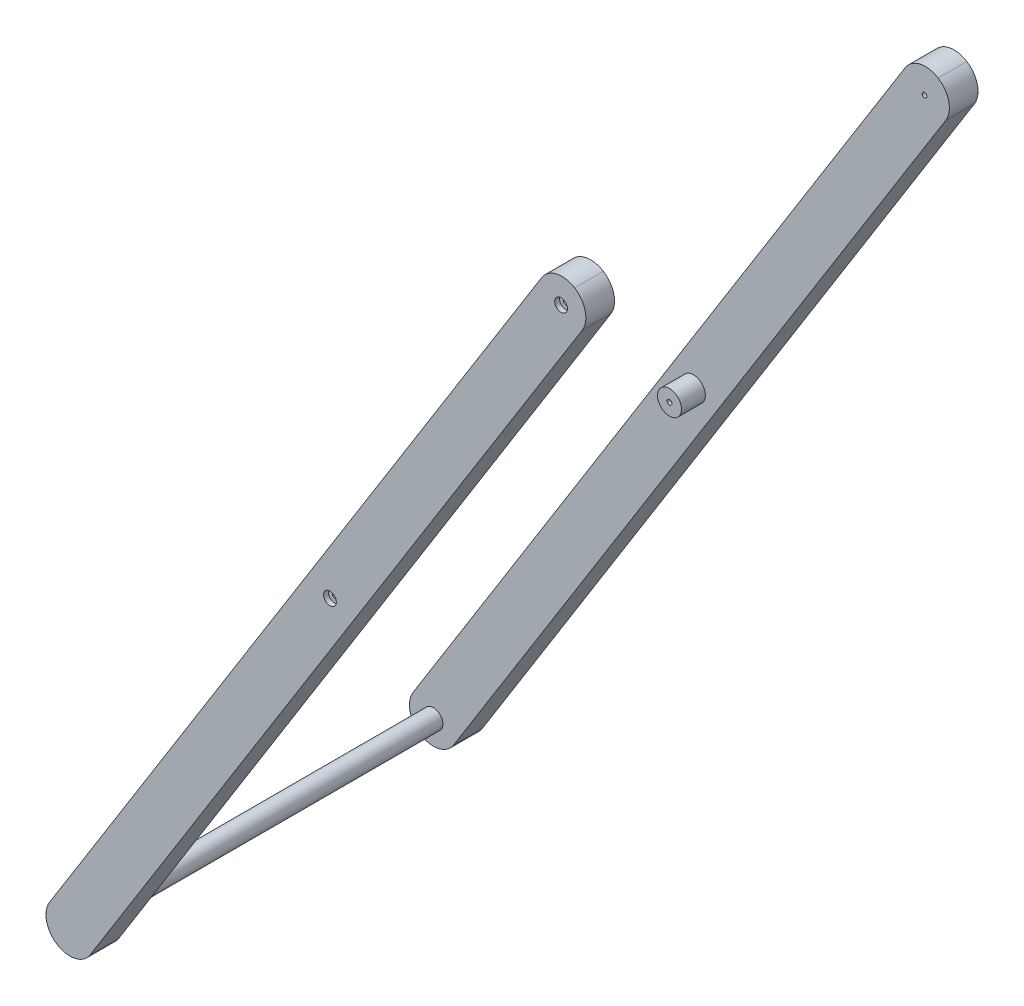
ISO-10303-21;
HEADER;
FILE_DESCRIPTION(('STEP AP214'),'2;1');
FILE_NAME('part.step','',(''),(''),'','','');
FILE_SCHEMA(('AUTOMOTIVE_DESIGN { 1 0 10303 214 1 1 1 1 }'));
ENDSEC;
DATA;
#1=APPLICATION_CONTEXT('core data for automotive mechanical design processes');
#2=APPLICATION_PROTOCOL_DEFINITION('international standard','automotive_design',2000,#1);
#3=PRODUCT_CONTEXT('',#1,'mechanical');
#4=PRODUCT('Part','Part','',(#3));
#5=PRODUCT_RELATED_PRODUCT_CATEGORY('part','',(#4));
#6=PRODUCT_DEFINITION_FORMATION('','',#4);
#7=PRODUCT_DEFINITION_CONTEXT('part definition',#1,'design');
#8=PRODUCT_DEFINITION('design','',#6,#7);
#9=PRODUCT_DEFINITION_SHAPE('','',#8);
#10=(LENGTH_UNIT() NAMED_UNIT(*) SI_UNIT(.MILLI.,.METRE.));
#11=(NAMED_UNIT(*) PLANE_ANGLE_UNIT() SI_UNIT($,.RADIAN.));
#12=(NAMED_UNIT(*) SI_UNIT($,.STERADIAN.) SOLID_ANGLE_UNIT());
#13=UNCERTAINTY_MEASURE_WITH_UNIT(LENGTH_MEASURE(1.E-05),#10,'distance_accuracy_value','');
#14=(GEOMETRIC_REPRESENTATION_CONTEXT(3) GLOBAL_UNCERTAINTY_ASSIGNED_CONTEXT((#13)) GLOBAL_UNIT_ASSIGNED_CONTEXT((#10,
#11,#12)) REPRESENTATION_CONTEXT('',''));
#15=CARTESIAN_POINT('',(0.,0.,0.));
#16=DIRECTION('',(0.,0.,1.));
#17=DIRECTION('',(1.,0.,0.));
#18=AXIS2_PLACEMENT_3D('',#15,#16,#17);
#19=CARTESIAN_POINT('',(0.,0.,105.));
#20=DIRECTION('',(0.,0.,-1.));
#21=DIRECTION('',(-1.,0.,0.));
#22=AXIS2_PLACEMENT_3D('',#19,#20,#21);
#23=PLANE('',#22);
#24=DIRECTION('',(-0.530185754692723,-0.847881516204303,0.));
#25=VECTOR('',#24,1.);
#26=CARTESIAN_POINT('',(140.764749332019,2.95278632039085,105.));
#27=LINE('',#26,#25);
#28=CARTESIAN_POINT('',(132.811963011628,-9.7654364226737,105.));
#29=VERTEX_POINT('',#28);
#30=CARTESIAN_POINT('',(-175.846018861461,-503.376204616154,105.));
#31=VERTEX_POINT('',#30);
#32=EDGE_CURVE('E225',#29,#31,#27,.T.);
#33=ORIENTED_EDGE('',*,*,#32,.F.);
#34=CARTESIAN_POINT('',(145.530185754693,-17.7182227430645,105.));
#35=DIRECTION('',(0.,0.,-1.));
#36=DIRECTION('',(-1.,0.,0.));
#37=AXIS2_PLACEMENT_3D('',#34,#35,#36);
#38=CIRCLE('',#37,15.);
#39=CARTESIAN_POINT('',(153.482972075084,-5.,105.));
#40=VERTEX_POINT('',#39);
#41=EDGE_CURVE('E250',#29,#40,#38,.T.);
#42=ORIENTED_EDGE('',*,*,#41,.T.);
#43=CARTESIAN_POINT('',(145.530185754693,-17.7182227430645,105.));
#44=DIRECTION('',(0.,0.,-1.));
#45=DIRECTION('',(-1.,0.,0.));
#46=AXIS2_PLACEMENT_3D('',#43,#44,#45);
#47=CIRCLE('',#46,15.);
#48=CARTESIAN_POINT('',(158.248408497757,-25.6710090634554,105.));
#49=VERTEX_POINT('',#48);
#50=EDGE_CURVE('E248',#40,#49,#47,.T.);
#51=ORIENTED_EDGE('',*,*,#50,.T.);
#52=DIRECTION('',(0.530185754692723,0.847881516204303,0.));
#53=VECTOR('',#52,1.);
#54=CARTESIAN_POINT('',(166.201194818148,-12.9527863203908,105.));
#55=LINE('',#54,#53);
#56=CARTESIAN_POINT('',(-150.409573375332,-519.281777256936,105.));
#57=VERTEX_POINT('',#56);
#58=EDGE_CURVE('E222',#57,#49,#55,.T.);
#59=ORIENTED_EDGE('',*,*,#58,.F.);
#60=CARTESIAN_POINT('',(-163.127796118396,-511.328990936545,105.));
#61=DIRECTION('',(0.,0.,-1.));
#62=DIRECTION('',(-1.,0.,0.));
#63=AXIS2_PLACEMENT_3D('',#60,#61,#62);
#64=CIRCLE('',#63,15.);
#65=CARTESIAN_POINT('',(-171.080582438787,-524.047213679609,105.));
#66=VERTEX_POINT('',#65);
#67=EDGE_CURVE('E234',#57,#66,#64,.T.);
#68=ORIENTED_EDGE('',*,*,#67,.T.);
#69=CARTESIAN_POINT('',(-163.127796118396,-511.328990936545,105.));
#70=DIRECTION('',(0.,0.,-1.));
#71=DIRECTION('',(-1.,0.,0.));
#72=AXIS2_PLACEMENT_3D('',#69,#70,#71);
#73=CIRCLE('',#72,15.);
#74=EDGE_CURVE('E231',#66,#31,#73,.T.);
#75=ORIENTED_EDGE('',*,*,#74,.T.);
#76=EDGE_LOOP('',(#33,#42,#51,#59,#68,#75));
#77=FACE_BOUND('',#76,.T.);
#78=CARTESIAN_POINT('',(-163.127796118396,-511.328990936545,105.));
#79=DIRECTION('',(0.,0.,-1.));
#80=DIRECTION('',(-1.,0.,0.));
#81=AXIS2_PLACEMENT_3D('',#78,#79,#80);
#82=CIRCLE('',#81,5.99999999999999);
#83=CARTESIAN_POINT('',(-169.127796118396,-511.328990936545,105.));
#84=VERTEX_POINT('',#83);
#85=EDGE_CURVE('E190',#84,#84,#82,.F.);
#86=ORIENTED_EDGE('',*,*,#85,.T.);
#87=EDGE_LOOP('',(#86));
#88=FACE_BOUND('',#87,.T.);
#89=CARTESIAN_POINT('',(145.,-18.5661042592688,105.));
#90=DIRECTION('',(0.,0.,-1.));
#91=DIRECTION('',(-1.,0.,0.));
#92=AXIS2_PLACEMENT_3D('',#89,#90,#91);
#93=CIRCLE('',#92,1.5);
#94=CARTESIAN_POINT('',(143.5,-18.5661042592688,105.));
#95=VERTEX_POINT('',#94);
#96=EDGE_CURVE('E201',#95,#95,#93,.T.);
#97=ORIENTED_EDGE('',*,*,#96,.F.);
#98=EDGE_LOOP('',(#97));
#99=FACE_BOUND('',#98,.T.);
#100=CARTESIAN_POINT('',(0.,-250.452417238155,105.));
#101=DIRECTION('',(0.,0.,-1.));
#102=DIRECTION('',(-1.,0.,0.));
#103=AXIS2_PLACEMENT_3D('',#100,#101,#102);
#104=CIRCLE('',#103,7.5);
#105=CARTESIAN_POINT('',(-7.5,-250.452417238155,105.));
#106=VERTEX_POINT('',#105);
#107=EDGE_CURVE('E652',#106,#106,#104,.T.);
#108=ORIENTED_EDGE('',*,*,#107,.F.);
#109=EDGE_LOOP('',(#108));
#110=FACE_BOUND('',#109,.T.);
#111=ADVANCED_FACE('F47',(#77,#88,#99,#110),#23,.T.);
#112=CARTESIAN_POINT('',(0.,0.,123.));
#113=DIRECTION('',(0.,0.,-1.));
#114=DIRECTION('',(-1.,0.,0.));
#115=AXIS2_PLACEMENT_3D('',#112,#113,#114);
#116=PLANE('',#115);
#117=CARTESIAN_POINT('',(145.,-18.5661042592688,123.));
#118=DIRECTION('',(0.,0.,1.));
#119=DIRECTION('',(1.,0.,0.));
#120=AXIS2_PLACEMENT_3D('',#117,#118,#119);
#121=CIRCLE('',#120,3.99999999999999);
#122=CARTESIAN_POINT('',(149.,-18.5661042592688,123.));
#123=VERTEX_POINT('',#122);
#124=EDGE_CURVE('E204',#123,#123,#121,.T.);
#125=ORIENTED_EDGE('',*,*,#124,.F.);
#126=EDGE_LOOP('',(#125));
#127=FACE_BOUND('',#126,.T.);
#128=CARTESIAN_POINT('',(0.,-250.452417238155,123.));
#129=DIRECTION('',(0.,0.,1.));
#130=DIRECTION('',(1.,0.,0.));
#131=AXIS2_PLACEMENT_3D('',#128,#129,#130);
#132=CIRCLE('',#131,4.);
#133=CARTESIAN_POINT('',(4.,-250.452417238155,123.));
#134=VERTEX_POINT('',#133);
#135=EDGE_CURVE('E213',#134,#134,#132,.T.);
#136=ORIENTED_EDGE('',*,*,#135,.F.);
#137=EDGE_LOOP('',(#136));
#138=FACE_BOUND('',#137,.T.);
#139=CARTESIAN_POINT('',(145.530185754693,-17.7182227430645,123.));
#140=DIRECTION('',(0.,0.,-1.));
#141=DIRECTION('',(-1.,0.,0.));
#142=AXIS2_PLACEMENT_3D('',#139,#140,#141);
#143=CIRCLE('',#142,15.);
#144=CARTESIAN_POINT('',(158.248408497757,-25.6710090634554,123.));
#145=VERTEX_POINT('',#144);
#146=CARTESIAN_POINT('',(153.482972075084,-5.,123.));
#147=VERTEX_POINT('',#146);
#148=EDGE_CURVE('E63',#145,#147,#143,.F.);
#149=ORIENTED_EDGE('',*,*,#148,.T.);
#150=CARTESIAN_POINT('',(145.530185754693,-17.7182227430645,123.));
#151=DIRECTION('',(0.,0.,-1.));
#152=DIRECTION('',(-1.,0.,0.));
#153=AXIS2_PLACEMENT_3D('',#150,#151,#152);
#154=CIRCLE('',#153,15.);
#155=CARTESIAN_POINT('',(132.811963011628,-9.7654364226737,123.));
#156=VERTEX_POINT('',#155);
#157=EDGE_CURVE('E56',#147,#156,#154,.F.);
#158=ORIENTED_EDGE('',*,*,#157,.T.);
#159=DIRECTION('',(-0.530185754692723,-0.847881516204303,0.));
#160=VECTOR('',#159,1.);
#161=CARTESIAN_POINT('',(140.764749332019,2.95278632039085,123.));
#162=LINE('',#161,#160);
#163=CARTESIAN_POINT('',(-175.846018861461,-503.376204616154,123.));
#164=VERTEX_POINT('',#163);
#165=EDGE_CURVE('E219',#156,#164,#162,.T.);
#166=ORIENTED_EDGE('',*,*,#165,.T.);
#167=CARTESIAN_POINT('',(-163.127796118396,-511.328990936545,123.));
#168=DIRECTION('',(0.,0.,-1.));
#169=DIRECTION('',(-1.,0.,0.));
#170=AXIS2_PLACEMENT_3D('',#167,#168,#169);
#171=CIRCLE('',#170,15.);
#172=CARTESIAN_POINT('',(-171.080582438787,-524.047213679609,123.));
#173=VERTEX_POINT('',#172);
#174=EDGE_CURVE('E236',#164,#173,#171,.F.);
#175=ORIENTED_EDGE('',*,*,#174,.T.);
#176=CARTESIAN_POINT('',(-163.127796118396,-511.328990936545,123.));
#177=DIRECTION('',(0.,0.,-1.));
#178=DIRECTION('',(-1.,0.,0.));
#179=AXIS2_PLACEMENT_3D('',#176,#177,#178);
#180=CIRCLE('',#179,15.);
#181=CARTESIAN_POINT('',(-150.409573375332,-519.281777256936,123.));
#182=VERTEX_POINT('',#181);
#183=EDGE_CURVE('E238',#173,#182,#180,.F.);
#184=ORIENTED_EDGE('',*,*,#183,.T.);
#185=DIRECTION('',(0.530185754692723,0.847881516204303,0.));
#186=VECTOR('',#185,1.);
#187=CARTESIAN_POINT('',(166.201194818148,-12.9527863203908,123.));
#188=LINE('',#187,#186);
#189=EDGE_CURVE('E221',#182,#145,#188,.T.);
#190=ORIENTED_EDGE('',*,*,#189,.T.);
#191=EDGE_LOOP('',(#149,#158,#166,#175,#184,#190));
#192=FACE_BOUND('',#191,.T.);
#193=ADVANCED_FACE('F255',(#127,#138,#192),#116,.F.);
#194=CARTESIAN_POINT('',(140.764749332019,2.95278632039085,123.));
#195=DIRECTION('',(0.847881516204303,-0.530185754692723,0.));
#196=DIRECTION('',(0.530185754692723,0.847881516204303,0.));
#197=AXIS2_PLACEMENT_3D('',#194,#195,#196);
#198=PLANE('',#197);
#199=ORIENTED_EDGE('',*,*,#165,.F.);
#200=DIRECTION('',(0.,0.,-1.));
#201=VECTOR('',#200,1.);
#202=CARTESIAN_POINT('',(132.811963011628,-9.76543642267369,123.));
#203=LINE('',#202,#201);
#204=EDGE_CURVE('E243',#156,#29,#203,.T.);
#205=ORIENTED_EDGE('',*,*,#204,.T.);
#206=ORIENTED_EDGE('',*,*,#32,.T.);
#207=DIRECTION('',(0.,0.,-1.));
#208=VECTOR('',#207,1.);
#209=CARTESIAN_POINT('',(-175.846018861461,-503.376204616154,123.));
#210=LINE('',#209,#208);
#211=EDGE_CURVE('E240',#31,#164,#210,.F.);
#212=ORIENTED_EDGE('',*,*,#211,.T.);
#213=EDGE_LOOP('',(#199,#205,#206,#212));
#214=FACE_BOUND('',#213,.T.);
#215=ADVANCED_FACE('F260',(#214),#198,.F.);
#216=CARTESIAN_POINT('',(166.201194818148,-12.9527863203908,123.));
#217=DIRECTION('',(-0.847881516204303,0.530185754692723,0.));
#218=DIRECTION('',(-0.530185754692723,-0.847881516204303,0.));
#219=AXIS2_PLACEMENT_3D('',#216,#217,#218);
#220=PLANE('',#219);
#221=ORIENTED_EDGE('',*,*,#58,.T.);
#222=DIRECTION('',(0.,0.,-1.));
#223=VECTOR('',#222,1.);
#224=CARTESIAN_POINT('',(158.248408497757,-25.6710090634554,123.));
#225=LINE('',#224,#223);
#226=EDGE_CURVE('E12',#49,#145,#225,.F.);
#227=ORIENTED_EDGE('',*,*,#226,.T.);
#228=ORIENTED_EDGE('',*,*,#189,.F.);
#229=DIRECTION('',(0.,0.,-1.));
#230=VECTOR('',#229,1.);
#231=CARTESIAN_POINT('',(-150.409573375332,-519.281777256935,123.));
#232=LINE('',#231,#230);
#233=EDGE_CURVE('E224',#182,#57,#232,.T.);
#234=ORIENTED_EDGE('',*,*,#233,.T.);
#235=EDGE_LOOP('',(#221,#227,#228,#234));
#236=FACE_BOUND('',#235,.T.);
#237=ADVANCED_FACE('F289',(#236),#220,.F.);
#238=CARTESIAN_POINT('',(-163.127796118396,-511.328990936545,123.));
#239=DIRECTION('',(0.,0.,-1.));
#240=DIRECTION('',(-1.,0.,0.));
#241=AXIS2_PLACEMENT_3D('',#238,#239,#240);
#242=CYLINDRICAL_SURFACE('',#241,15.);
#243=DIRECTION('',(0.,0.,-1.));
#244=VECTOR('',#243,1.);
#245=CARTESIAN_POINT('',(-171.080582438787,-524.047213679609,123.));
#246=LINE('',#245,#244);
#247=EDGE_CURVE('E227',#173,#66,#246,.T.);
#248=ORIENTED_EDGE('',*,*,#247,.F.);
#249=ORIENTED_EDGE('',*,*,#174,.F.);
#250=ORIENTED_EDGE('',*,*,#211,.F.);
#251=ORIENTED_EDGE('',*,*,#74,.F.);
#252=EDGE_LOOP('',(#248,#249,#250,#251));
#253=FACE_BOUND('',#252,.T.);
#254=ADVANCED_FACE('F277',(#253),#242,.T.);
#255=CARTESIAN_POINT('',(-163.127796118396,-511.328990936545,123.));
#256=DIRECTION('',(0.,0.,-1.));
#257=DIRECTION('',(-1.,0.,0.));
#258=AXIS2_PLACEMENT_3D('',#255,#256,#257);
#259=CYLINDRICAL_SURFACE('',#258,15.);
#260=ORIENTED_EDGE('',*,*,#183,.F.);
#261=ORIENTED_EDGE('',*,*,#247,.T.);
#262=ORIENTED_EDGE('',*,*,#67,.F.);
#263=ORIENTED_EDGE('',*,*,#233,.F.);
#264=EDGE_LOOP('',(#260,#261,#262,#263));
#265=FACE_BOUND('',#264,.T.);
#266=ADVANCED_FACE('F271',(#265),#259,.T.);
#267=CARTESIAN_POINT('',(145.530185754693,-17.7182227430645,123.));
#268=DIRECTION('',(0.,0.,-1.));
#269=DIRECTION('',(-1.,0.,0.));
#270=AXIS2_PLACEMENT_3D('',#267,#268,#269);
#271=CYLINDRICAL_SURFACE('',#270,15.);
#272=DIRECTION('',(0.,0.,-1.));
#273=VECTOR('',#272,1.);
#274=CARTESIAN_POINT('',(153.482972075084,-5.,123.));
#275=LINE('',#274,#273);
#276=EDGE_CURVE('E51',#147,#40,#275,.T.);
#277=ORIENTED_EDGE('',*,*,#276,.F.);
#278=ORIENTED_EDGE('',*,*,#148,.F.);
#279=ORIENTED_EDGE('',*,*,#226,.F.);
#280=ORIENTED_EDGE('',*,*,#50,.F.);
#281=EDGE_LOOP('',(#277,#278,#279,#280));
#282=FACE_BOUND('',#281,.T.);
#283=ADVANCED_FACE('F49',(#282),#271,.T.);
#284=CARTESIAN_POINT('',(145.530185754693,-17.7182227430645,123.));
#285=DIRECTION('',(0.,0.,-1.));
#286=DIRECTION('',(-1.,0.,0.));
#287=AXIS2_PLACEMENT_3D('',#284,#285,#286);
#288=CYLINDRICAL_SURFACE('',#287,15.);
#289=ORIENTED_EDGE('',*,*,#157,.F.);
#290=ORIENTED_EDGE('',*,*,#276,.T.);
#291=ORIENTED_EDGE('',*,*,#41,.F.);
#292=ORIENTED_EDGE('',*,*,#204,.F.);
#293=EDGE_LOOP('',(#289,#290,#291,#292));
#294=FACE_BOUND('',#293,.T.);
#295=ADVANCED_FACE('F264',(#294),#288,.T.);
#296=CARTESIAN_POINT('',(0.,-250.452417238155,120.));
#297=DIRECTION('',(0.,0.,1.));
#298=DIRECTION('',(1.,0.,0.));
#299=AXIS2_PLACEMENT_3D('',#296,#297,#298);
#300=CYLINDRICAL_SURFACE('',#299,4.);
#301=CARTESIAN_POINT('',(0.,-250.452417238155,120.));
#302=DIRECTION('',(0.,0.,1.));
#303=DIRECTION('',(1.,0.,0.));
#304=AXIS2_PLACEMENT_3D('',#301,#302,#303);
#305=CIRCLE('',#304,4.);
#306=CARTESIAN_POINT('',(4.,-250.452417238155,120.));
#307=VERTEX_POINT('',#306);
#308=EDGE_CURVE('E214',#307,#307,#305,.T.);
#309=ORIENTED_EDGE('',*,*,#308,.F.);
#310=EDGE_LOOP('',(#309));
#311=FACE_BOUND('',#310,.T.);
#312=ORIENTED_EDGE('',*,*,#135,.T.);
#313=EDGE_LOOP('',(#312));
#314=FACE_BOUND('',#313,.T.);
#315=ADVANCED_FACE('F276',(#311,#314),#300,.F.);
#316=CARTESIAN_POINT('',(0.,-250.452417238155,120.));
#317=DIRECTION('',(0.,0.,1.));
#318=DIRECTION('',(1.,0.,0.));
#319=AXIS2_PLACEMENT_3D('',#316,#317,#318);
#320=PLANE('',#319);
#321=CARTESIAN_POINT('',(0.,-250.452417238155,120.));
#322=DIRECTION('',(0.,0.,1.));
#323=DIRECTION('',(1.,0.,0.));
#324=AXIS2_PLACEMENT_3D('',#321,#322,#323);
#325=CIRCLE('',#324,1.5);
#326=CARTESIAN_POINT('',(1.5,-250.452417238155,120.));
#327=VERTEX_POINT('',#326);
#328=EDGE_CURVE('E208',#327,#327,#325,.T.);
#329=ORIENTED_EDGE('',*,*,#328,.F.);
#330=EDGE_LOOP('',(#329));
#331=FACE_BOUND('',#330,.T.);
#332=ORIENTED_EDGE('',*,*,#308,.T.);
#333=EDGE_LOOP('',(#332));
#334=FACE_BOUND('',#333,.T.);
#335=ADVANCED_FACE('F330',(#331,#334),#320,.T.);
#336=CARTESIAN_POINT('',(0.,-250.452417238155,67.7573593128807));
#337=DIRECTION('',(0.,0.,1.));
#338=DIRECTION('',(1.,0.,0.));
#339=AXIS2_PLACEMENT_3D('',#336,#337,#338);
#340=CYLINDRICAL_SURFACE('',#339,1.5);
#341=ORIENTED_EDGE('',*,*,#328,.T.);
#342=EDGE_LOOP('',(#341));
#343=FACE_BOUND('',#342,.T.);
#344=CARTESIAN_POINT('',(0.,-250.452417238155,90.));
#345=DIRECTION('',(0.,0.,-1.));
#346=DIRECTION('',(-1.,0.,0.));
#347=AXIS2_PLACEMENT_3D('',#344,#345,#346);
#348=CIRCLE('',#347,1.5);
#349=CARTESIAN_POINT('',(-1.5,-250.452417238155,90.));
#350=VERTEX_POINT('',#349);
#351=EDGE_CURVE('E658',#350,#350,#348,.F.);
#352=ORIENTED_EDGE('',*,*,#351,.F.);
#353=EDGE_LOOP('',(#352));
#354=FACE_BOUND('',#353,.T.);
#355=ADVANCED_FACE('F339',(#343,#354),#340,.F.);
#356=CARTESIAN_POINT('',(145.,-18.5661042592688,120.));
#357=DIRECTION('',(0.,0.,1.));
#358=DIRECTION('',(1.,0.,0.));
#359=AXIS2_PLACEMENT_3D('',#356,#357,#358);
#360=CYLINDRICAL_SURFACE('',#359,3.99999999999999);
#361=CARTESIAN_POINT('',(145.,-18.5661042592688,120.));
#362=DIRECTION('',(0.,0.,1.));
#363=DIRECTION('',(1.,0.,0.));
#364=AXIS2_PLACEMENT_3D('',#361,#362,#363);
#365=CIRCLE('',#364,3.99999999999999);
#366=CARTESIAN_POINT('',(149.,-18.5661042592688,120.));
#367=VERTEX_POINT('',#366);
#368=EDGE_CURVE('E205',#367,#367,#365,.T.);
#369=ORIENTED_EDGE('',*,*,#368,.F.);
#370=EDGE_LOOP('',(#369));
#371=FACE_BOUND('',#370,.T.);
#372=ORIENTED_EDGE('',*,*,#124,.T.);
#373=EDGE_LOOP('',(#372));
#374=FACE_BOUND('',#373,.T.);
#375=ADVANCED_FACE('F349',(#371,#374),#360,.F.);
#376=CARTESIAN_POINT('',(145.,-18.5661042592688,120.));
#377=DIRECTION('',(0.,0.,1.));
#378=DIRECTION('',(1.,0.,0.));
#379=AXIS2_PLACEMENT_3D('',#376,#377,#378);
#380=PLANE('',#379);
#381=CARTESIAN_POINT('',(145.,-18.5661042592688,120.));
#382=DIRECTION('',(0.,0.,1.));
#383=DIRECTION('',(1.,0.,0.));
#384=AXIS2_PLACEMENT_3D('',#381,#382,#383);
#385=CIRCLE('',#384,1.5);
#386=CARTESIAN_POINT('',(146.5,-18.5661042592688,120.));
#387=VERTEX_POINT('',#386);
#388=EDGE_CURVE('E198',#387,#387,#385,.T.);
#389=ORIENTED_EDGE('',*,*,#388,.F.);
#390=EDGE_LOOP('',(#389));
#391=FACE_BOUND('',#390,.T.);
#392=ORIENTED_EDGE('',*,*,#368,.T.);
#393=EDGE_LOOP('',(#392));
#394=FACE_BOUND('',#393,.T.);
#395=ADVANCED_FACE('F363',(#391,#394),#380,.T.);
#396=CARTESIAN_POINT('',(145.,-18.5661042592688,85.7573593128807));
#397=DIRECTION('',(0.,0.,1.));
#398=DIRECTION('',(1.,0.,0.));
#399=AXIS2_PLACEMENT_3D('',#396,#397,#398);
#400=CYLINDRICAL_SURFACE('',#399,1.5);
#401=ORIENTED_EDGE('',*,*,#96,.T.);
#402=EDGE_LOOP('',(#401));
#403=FACE_BOUND('',#402,.T.);
#404=ORIENTED_EDGE('',*,*,#388,.T.);
#405=EDGE_LOOP('',(#404));
#406=FACE_BOUND('',#405,.T.);
#407=ADVANCED_FACE('F373',(#403,#406),#400,.F.);
#408=CARTESIAN_POINT('',(0.,0.,-123.));
#409=DIRECTION('',(0.,0.,1.));
#410=DIRECTION('',(-1.,0.,0.));
#411=AXIS2_PLACEMENT_3D('',#408,#409,#410);
#412=PLANE('',#411);
#413=CARTESIAN_POINT('',(145.,-18.5661042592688,-123.));
#414=DIRECTION('',(0.,0.,1.));
#415=DIRECTION('',(1.,0.,0.));
#416=AXIS2_PLACEMENT_3D('',#413,#414,#415);
#417=CIRCLE('',#416,3.99999999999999);
#418=CARTESIAN_POINT('',(149.,-18.5661042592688,-123.));
#419=VERTEX_POINT('',#418);
#420=EDGE_CURVE('E675',#419,#419,#417,.T.);
#421=ORIENTED_EDGE('',*,*,#420,.T.);
#422=EDGE_LOOP('',(#421));
#423=FACE_BOUND('',#422,.T.);
#424=CARTESIAN_POINT('',(0.,-250.452417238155,-123.));
#425=DIRECTION('',(0.,0.,1.));
#426=DIRECTION('',(1.,0.,0.));
#427=AXIS2_PLACEMENT_3D('',#424,#425,#426);
#428=CIRCLE('',#427,4.);
#429=CARTESIAN_POINT('',(4.,-250.452417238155,-123.));
#430=VERTEX_POINT('',#429);
#431=EDGE_CURVE('E684',#430,#430,#428,.T.);
#432=ORIENTED_EDGE('',*,*,#431,.T.);
#433=EDGE_LOOP('',(#432));
#434=FACE_BOUND('',#433,.T.);
#435=CARTESIAN_POINT('',(145.530185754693,-17.7182227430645,-123.));
#436=DIRECTION('',(0.,0.,-1.));
#437=DIRECTION('',(-1.,0.,0.));
#438=AXIS2_PLACEMENT_3D('',#435,#436,#437);
#439=CIRCLE('',#438,15.);
#440=CARTESIAN_POINT('',(158.248408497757,-25.6710090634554,-123.));
#441=VERTEX_POINT('',#440);
#442=CARTESIAN_POINT('',(153.482972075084,-5.,-123.));
#443=VERTEX_POINT('',#442);
#444=EDGE_CURVE('E183',#441,#443,#439,.F.);
#445=ORIENTED_EDGE('',*,*,#444,.F.);
#446=DIRECTION('',(0.530185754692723,0.847881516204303,0.));
#447=VECTOR('',#446,1.);
#448=CARTESIAN_POINT('',(166.201194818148,-12.9527863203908,-123.));
#449=LINE('',#448,#447);
#450=CARTESIAN_POINT('',(-150.409573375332,-519.281777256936,-123.));
#451=VERTEX_POINT('',#450);
#452=EDGE_CURVE('E149',#451,#441,#449,.T.);
#453=ORIENTED_EDGE('',*,*,#452,.F.);
#454=CARTESIAN_POINT('',(-163.127796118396,-511.328990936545,-123.));
#455=DIRECTION('',(0.,0.,-1.));
#456=DIRECTION('',(-1.,0.,0.));
#457=AXIS2_PLACEMENT_3D('',#454,#455,#456);
#458=CIRCLE('',#457,15.);
#459=CARTESIAN_POINT('',(-171.080582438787,-524.047213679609,-123.));
#460=VERTEX_POINT('',#459);
#461=EDGE_CURVE('E144',#460,#451,#458,.F.);
#462=ORIENTED_EDGE('',*,*,#461,.F.);
#463=CARTESIAN_POINT('',(-163.127796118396,-511.328990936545,-123.));
#464=DIRECTION('',(0.,0.,-1.));
#465=DIRECTION('',(-1.,0.,0.));
#466=AXIS2_PLACEMENT_3D('',#463,#464,#465);
#467=CIRCLE('',#466,15.);
#468=CARTESIAN_POINT('',(-175.846018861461,-503.376204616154,-123.));
#469=VERTEX_POINT('',#468);
#470=EDGE_CURVE('E164',#469,#460,#467,.F.);
#471=ORIENTED_EDGE('',*,*,#470,.F.);
#472=DIRECTION('',(-0.530185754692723,-0.847881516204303,0.));
#473=VECTOR('',#472,1.);
#474=CARTESIAN_POINT('',(140.764749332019,2.95278632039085,-123.));
#475=LINE('',#474,#473);
#476=CARTESIAN_POINT('',(132.811963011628,-9.7654364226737,-123.));
#477=VERTEX_POINT('',#476);
#478=EDGE_CURVE('E158',#477,#469,#475,.T.);
#479=ORIENTED_EDGE('',*,*,#478,.F.);
#480=CARTESIAN_POINT('',(145.530185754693,-17.7182227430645,-123.));
#481=DIRECTION('',(0.,0.,-1.));
#482=DIRECTION('',(-1.,0.,0.));
#483=AXIS2_PLACEMENT_3D('',#480,#481,#482);
#484=CIRCLE('',#483,15.);
#485=EDGE_CURVE('E186',#443,#477,#484,.F.);
#486=ORIENTED_EDGE('',*,*,#485,.F.);
#487=EDGE_LOOP('',(#445,#453,#462,#471,#479,#486));
#488=FACE_BOUND('',#487,.T.);
#489=ADVANCED_FACE('F383',(#423,#434,#488),#412,.F.);
#490=CARTESIAN_POINT('',(0.,0.,-105.));
#491=DIRECTION('',(0.,0.,1.));
#492=DIRECTION('',(-1.,0.,0.));
#493=AXIS2_PLACEMENT_3D('',#490,#491,#492);
#494=PLANE('',#493);
#495=CARTESIAN_POINT('',(0.,-250.452417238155,-105.));
#496=DIRECTION('',(0.,0.,-1.));
#497=DIRECTION('',(-1.,0.,0.));
#498=AXIS2_PLACEMENT_3D('',#495,#496,#497);
#499=CIRCLE('',#498,7.5);
#500=CARTESIAN_POINT('',(-7.5,-250.452417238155,-105.));
#501=VERTEX_POINT('',#500);
#502=EDGE_CURVE('E657',#501,#501,#499,.T.);
#503=ORIENTED_EDGE('',*,*,#502,.T.);
#504=EDGE_LOOP('',(#503));
#505=FACE_BOUND('',#504,.T.);
#506=CARTESIAN_POINT('',(145.,-18.5661042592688,-105.));
#507=DIRECTION('',(0.,0.,-1.));
#508=DIRECTION('',(-1.,0.,0.));
#509=AXIS2_PLACEMENT_3D('',#506,#507,#508);
#510=CIRCLE('',#509,1.5);
#511=CARTESIAN_POINT('',(143.5,-18.5661042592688,-105.));
#512=VERTEX_POINT('',#511);
#513=EDGE_CURVE('E670',#512,#512,#510,.T.);
#514=ORIENTED_EDGE('',*,*,#513,.T.);
#515=EDGE_LOOP('',(#514));
#516=FACE_BOUND('',#515,.T.);
#517=CARTESIAN_POINT('',(-163.127796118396,-511.328990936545,-105.));
#518=DIRECTION('',(0.,0.,1.));
#519=DIRECTION('',(1.,0.,0.));
#520=AXIS2_PLACEMENT_3D('',#517,#518,#519);
#521=CIRCLE('',#520,5.99999999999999);
#522=CARTESIAN_POINT('',(-157.127796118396,-511.328990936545,-105.));
#523=VERTEX_POINT('',#522);
#524=EDGE_CURVE('E192',#523,#523,#521,.F.);
#525=ORIENTED_EDGE('',*,*,#524,.T.);
#526=EDGE_LOOP('',(#525));
#527=FACE_BOUND('',#526,.T.);
#528=DIRECTION('',(-0.530185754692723,-0.847881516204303,0.));
#529=VECTOR('',#528,1.);
#530=CARTESIAN_POINT('',(140.764749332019,2.95278632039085,-105.));
#531=LINE('',#530,#529);
#532=CARTESIAN_POINT('',(132.811963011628,-9.7654364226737,-105.));
#533=VERTEX_POINT('',#532);
#534=CARTESIAN_POINT('',(-175.846018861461,-503.376204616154,-105.));
#535=VERTEX_POINT('',#534);
#536=EDGE_CURVE('E159',#533,#535,#531,.T.);
#537=ORIENTED_EDGE('',*,*,#536,.T.);
#538=CARTESIAN_POINT('',(-163.127796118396,-511.328990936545,-105.));
#539=DIRECTION('',(0.,0.,-1.));
#540=DIRECTION('',(-1.,0.,0.));
#541=AXIS2_PLACEMENT_3D('',#538,#539,#540);
#542=CIRCLE('',#541,15.);
#543=CARTESIAN_POINT('',(-171.080582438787,-524.047213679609,-105.));
#544=VERTEX_POINT('',#543);
#545=EDGE_CURVE('E148',#544,#535,#542,.T.);
#546=ORIENTED_EDGE('',*,*,#545,.F.);
#547=CARTESIAN_POINT('',(-163.127796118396,-511.328990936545,-105.));
#548=DIRECTION('',(0.,0.,-1.));
#549=DIRECTION('',(-1.,0.,0.));
#550=AXIS2_PLACEMENT_3D('',#547,#548,#549);
#551=CIRCLE('',#550,15.);
#552=CARTESIAN_POINT('',(-150.409573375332,-519.281777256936,-105.));
#553=VERTEX_POINT('',#552);
#554=EDGE_CURVE('E141',#553,#544,#551,.T.);
#555=ORIENTED_EDGE('',*,*,#554,.F.);
#556=DIRECTION('',(0.530185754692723,0.847881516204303,0.));
#557=VECTOR('',#556,1.);
#558=CARTESIAN_POINT('',(166.201194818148,-12.9527863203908,-105.));
#559=LINE('',#558,#557);
#560=CARTESIAN_POINT('',(158.248408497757,-25.6710090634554,-105.));
#561=VERTEX_POINT('',#560);
#562=EDGE_CURVE('E152',#553,#561,#559,.T.);
#563=ORIENTED_EDGE('',*,*,#562,.T.);
#564=CARTESIAN_POINT('',(145.530185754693,-17.7182227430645,-105.));
#565=DIRECTION('',(0.,0.,-1.));
#566=DIRECTION('',(-1.,0.,0.));
#567=AXIS2_PLACEMENT_3D('',#564,#565,#566);
#568=CIRCLE('',#567,15.);
#569=CARTESIAN_POINT('',(153.482972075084,-5.,-105.));
#570=VERTEX_POINT('',#569);
#571=EDGE_CURVE('E178',#570,#561,#568,.T.);
#572=ORIENTED_EDGE('',*,*,#571,.F.);
#573=CARTESIAN_POINT('',(145.530185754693,-17.7182227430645,-105.));
#574=DIRECTION('',(0.,0.,-1.));
#575=DIRECTION('',(-1.,0.,0.));
#576=AXIS2_PLACEMENT_3D('',#573,#574,#575);
#577=CIRCLE('',#576,15.);
#578=EDGE_CURVE('E180',#533,#570,#577,.T.);
#579=ORIENTED_EDGE('',*,*,#578,.F.);
#580=EDGE_LOOP('',(#537,#546,#555,#563,#572,#579));
#581=FACE_BOUND('',#580,.T.);
#582=ADVANCED_FACE('F162',(#505,#516,#527,#581),#494,.T.);
#583=CARTESIAN_POINT('',(140.764749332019,2.95278632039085,-123.));
#584=DIRECTION('',(0.847881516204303,-0.530185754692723,0.));
#585=DIRECTION('',(0.530185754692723,0.847881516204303,0.));
#586=AXIS2_PLACEMENT_3D('',#583,#584,#585);
#587=PLANE('',#586);
#588=ORIENTED_EDGE('',*,*,#478,.T.);
#589=DIRECTION('',(0.,0.,1.));
#590=VECTOR('',#589,1.);
#591=CARTESIAN_POINT('',(-175.846018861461,-503.376204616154,-123.));
#592=LINE('',#591,#590);
#593=EDGE_CURVE('E171',#535,#469,#592,.F.);
#594=ORIENTED_EDGE('',*,*,#593,.F.);
#595=ORIENTED_EDGE('',*,*,#536,.F.);
#596=DIRECTION('',(0.,0.,1.));
#597=VECTOR('',#596,1.);
#598=CARTESIAN_POINT('',(132.811963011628,-9.76543642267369,-123.));
#599=LINE('',#598,#597);
#600=EDGE_CURVE('E173',#477,#533,#599,.T.);
#601=ORIENTED_EDGE('',*,*,#600,.F.);
#602=EDGE_LOOP('',(#588,#594,#595,#601));
#603=FACE_BOUND('',#602,.T.);
#604=ADVANCED_FACE('F403',(#603),#587,.F.);
#605=CARTESIAN_POINT('',(166.201194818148,-12.9527863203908,-123.));
#606=DIRECTION('',(-0.847881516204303,0.530185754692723,0.));
#607=DIRECTION('',(-0.530185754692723,-0.847881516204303,0.));
#608=AXIS2_PLACEMENT_3D('',#605,#606,#607);
#609=PLANE('',#608);
#610=ORIENTED_EDGE('',*,*,#562,.F.);
#611=DIRECTION('',(0.,0.,1.));
#612=VECTOR('',#611,1.);
#613=CARTESIAN_POINT('',(-150.409573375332,-519.281777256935,-123.));
#614=LINE('',#613,#612);
#615=EDGE_CURVE('E137',#451,#553,#614,.T.);
#616=ORIENTED_EDGE('',*,*,#615,.F.);
#617=ORIENTED_EDGE('',*,*,#452,.T.);
#618=DIRECTION('',(0.,0.,1.));
#619=VECTOR('',#618,1.);
#620=CARTESIAN_POINT('',(158.248408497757,-25.6710090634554,-123.));
#621=LINE('',#620,#619);
#622=EDGE_CURVE('E154',#561,#441,#621,.F.);
#623=ORIENTED_EDGE('',*,*,#622,.F.);
#624=EDGE_LOOP('',(#610,#616,#617,#623));
#625=FACE_BOUND('',#624,.T.);
#626=ADVANCED_FACE('F153',(#625),#609,.F.);
#627=CARTESIAN_POINT('',(-163.127796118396,-511.328990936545,-123.));
#628=DIRECTION('',(0.,0.,1.));
#629=DIRECTION('',(-1.,0.,0.));
#630=AXIS2_PLACEMENT_3D('',#627,#628,#629);
#631=CYLINDRICAL_SURFACE('',#630,15.);
#632=DIRECTION('',(0.,0.,1.));
#633=VECTOR('',#632,1.);
#634=CARTESIAN_POINT('',(-171.080582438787,-524.047213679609,-123.));
#635=LINE('',#634,#633);
#636=EDGE_CURVE('E174',#460,#544,#635,.T.);
#637=ORIENTED_EDGE('',*,*,#636,.T.);
#638=ORIENTED_EDGE('',*,*,#545,.T.);
#639=ORIENTED_EDGE('',*,*,#593,.T.);
#640=ORIENTED_EDGE('',*,*,#470,.T.);
#641=EDGE_LOOP('',(#637,#638,#639,#640));
#642=FACE_BOUND('',#641,.T.);
#643=ADVANCED_FACE('F424',(#642),#631,.T.);
#644=CARTESIAN_POINT('',(-163.127796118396,-511.328990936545,-123.));
#645=DIRECTION('',(0.,0.,1.));
#646=DIRECTION('',(-1.,0.,0.));
#647=AXIS2_PLACEMENT_3D('',#644,#645,#646);
#648=CYLINDRICAL_SURFACE('',#647,15.);
#649=ORIENTED_EDGE('',*,*,#461,.T.);
#650=ORIENTED_EDGE('',*,*,#615,.T.);
#651=ORIENTED_EDGE('',*,*,#554,.T.);
#652=ORIENTED_EDGE('',*,*,#636,.F.);
#653=EDGE_LOOP('',(#649,#650,#651,#652));
#654=FACE_BOUND('',#653,.T.);
#655=ADVANCED_FACE('F139',(#654),#648,.T.);
#656=CARTESIAN_POINT('',(145.530185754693,-17.7182227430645,-123.));
#657=DIRECTION('',(0.,0.,1.));
#658=DIRECTION('',(-1.,0.,0.));
#659=AXIS2_PLACEMENT_3D('',#656,#657,#658);
#660=CYLINDRICAL_SURFACE('',#659,15.);
#661=DIRECTION('',(0.,0.,1.));
#662=VECTOR('',#661,1.);
#663=CARTESIAN_POINT('',(153.482972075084,-5.,-123.));
#664=LINE('',#663,#662);
#665=EDGE_CURVE('E176',#443,#570,#664,.T.);
#666=ORIENTED_EDGE('',*,*,#665,.T.);
#667=ORIENTED_EDGE('',*,*,#571,.T.);
#668=ORIENTED_EDGE('',*,*,#622,.T.);
#669=ORIENTED_EDGE('',*,*,#444,.T.);
#670=EDGE_LOOP('',(#666,#667,#668,#669));
#671=FACE_BOUND('',#670,.T.);
#672=ADVANCED_FACE('F444',(#671),#660,.T.);
#673=CARTESIAN_POINT('',(145.530185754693,-17.7182227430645,-123.));
#674=DIRECTION('',(0.,0.,1.));
#675=DIRECTION('',(-1.,0.,0.));
#676=AXIS2_PLACEMENT_3D('',#673,#674,#675);
#677=CYLINDRICAL_SURFACE('',#676,15.);
#678=ORIENTED_EDGE('',*,*,#485,.T.);
#679=ORIENTED_EDGE('',*,*,#600,.T.);
#680=ORIENTED_EDGE('',*,*,#578,.T.);
#681=ORIENTED_EDGE('',*,*,#665,.F.);
#682=EDGE_LOOP('',(#678,#679,#680,#681));
#683=FACE_BOUND('',#682,.T.);
#684=ADVANCED_FACE('F454',(#683),#677,.T.);
#685=CARTESIAN_POINT('',(0.,-250.452417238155,-120.));
#686=DIRECTION('',(0.,0.,-1.));
#687=DIRECTION('',(1.,0.,0.));
#688=AXIS2_PLACEMENT_3D('',#685,#686,#687);
#689=CYLINDRICAL_SURFACE('',#688,4.);
#690=CARTESIAN_POINT('',(0.,-250.452417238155,-120.));
#691=DIRECTION('',(0.,0.,1.));
#692=DIRECTION('',(1.,0.,0.));
#693=AXIS2_PLACEMENT_3D('',#690,#691,#692);
#694=CIRCLE('',#693,4.);
#695=CARTESIAN_POINT('',(4.,-250.452417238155,-120.));
#696=VERTEX_POINT('',#695);
#697=EDGE_CURVE('E195',#696,#696,#694,.T.);
#698=ORIENTED_EDGE('',*,*,#697,.T.);
#699=EDGE_LOOP('',(#698));
#700=FACE_BOUND('',#699,.T.);
#701=ORIENTED_EDGE('',*,*,#431,.F.);
#702=EDGE_LOOP('',(#701));
#703=FACE_BOUND('',#702,.T.);
#704=ADVANCED_FACE('F465',(#700,#703),#689,.F.);
#705=CARTESIAN_POINT('',(0.,-250.452417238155,-120.));
#706=DIRECTION('',(0.,0.,-1.));
#707=DIRECTION('',(1.,0.,0.));
#708=AXIS2_PLACEMENT_3D('',#705,#706,#707);
#709=PLANE('',#708);
#710=CARTESIAN_POINT('',(0.,-250.452417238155,-120.));
#711=DIRECTION('',(0.,0.,1.));
#712=DIRECTION('',(1.,0.,0.));
#713=AXIS2_PLACEMENT_3D('',#710,#711,#712);
#714=CIRCLE('',#713,1.5);
#715=CARTESIAN_POINT('',(1.5,-250.452417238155,-120.));
#716=VERTEX_POINT('',#715);
#717=EDGE_CURVE('E687',#716,#716,#714,.T.);
#718=ORIENTED_EDGE('',*,*,#717,.T.);
#719=EDGE_LOOP('',(#718));
#720=FACE_BOUND('',#719,.T.);
#721=ORIENTED_EDGE('',*,*,#697,.F.);
#722=EDGE_LOOP('',(#721));
#723=FACE_BOUND('',#722,.T.);
#724=ADVANCED_FACE('F476',(#720,#723),#709,.T.);
#725=CARTESIAN_POINT('',(0.,-250.452417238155,-67.7573593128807));
#726=DIRECTION('',(0.,0.,-1.));
#727=DIRECTION('',(1.,0.,0.));
#728=AXIS2_PLACEMENT_3D('',#725,#726,#727);
#729=CYLINDRICAL_SURFACE('',#728,1.5);
#730=ORIENTED_EDGE('',*,*,#717,.F.);
#731=EDGE_LOOP('',(#730));
#732=FACE_BOUND('',#731,.T.);
#733=CARTESIAN_POINT('',(0.,-250.452417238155,-90.));
#734=DIRECTION('',(0.,0.,-1.));
#735=DIRECTION('',(-1.,0.,0.));
#736=AXIS2_PLACEMENT_3D('',#733,#734,#735);
#737=CIRCLE('',#736,1.5);
#738=CARTESIAN_POINT('',(-1.5,-250.452417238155,-90.));
#739=VERTEX_POINT('',#738);
#740=EDGE_CURVE('E661',#739,#739,#737,.F.);
#741=ORIENTED_EDGE('',*,*,#740,.T.);
#742=EDGE_LOOP('',(#741));
#743=FACE_BOUND('',#742,.T.);
#744=ADVANCED_FACE('F487',(#732,#743),#729,.F.);
#745=CARTESIAN_POINT('',(145.,-18.5661042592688,-120.));
#746=DIRECTION('',(0.,0.,-1.));
#747=DIRECTION('',(1.,0.,0.));
#748=AXIS2_PLACEMENT_3D('',#745,#746,#747);
#749=CYLINDRICAL_SURFACE('',#748,3.99999999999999);
#750=CARTESIAN_POINT('',(145.,-18.5661042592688,-120.));
#751=DIRECTION('',(0.,0.,1.));
#752=DIRECTION('',(1.,0.,0.));
#753=AXIS2_PLACEMENT_3D('',#750,#751,#752);
#754=CIRCLE('',#753,3.99999999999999);
#755=CARTESIAN_POINT('',(149.,-18.5661042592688,-120.));
#756=VERTEX_POINT('',#755);
#757=EDGE_CURVE('E681',#756,#756,#754,.T.);
#758=ORIENTED_EDGE('',*,*,#757,.T.);
#759=EDGE_LOOP('',(#758));
#760=FACE_BOUND('',#759,.T.);
#761=ORIENTED_EDGE('',*,*,#420,.F.);
#762=EDGE_LOOP('',(#761));
#763=FACE_BOUND('',#762,.T.);
#764=ADVANCED_FACE('F498',(#760,#763),#749,.F.);
#765=CARTESIAN_POINT('',(145.,-18.5661042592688,-120.));
#766=DIRECTION('',(0.,0.,-1.));
#767=DIRECTION('',(1.,0.,0.));
#768=AXIS2_PLACEMENT_3D('',#765,#766,#767);
#769=PLANE('',#768);
#770=CARTESIAN_POINT('',(145.,-18.5661042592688,-120.));
#771=DIRECTION('',(0.,0.,1.));
#772=DIRECTION('',(1.,0.,0.));
#773=AXIS2_PLACEMENT_3D('',#770,#771,#772);
#774=CIRCLE('',#773,1.5);
#775=CARTESIAN_POINT('',(146.5,-18.5661042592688,-120.));
#776=VERTEX_POINT('',#775);
#777=EDGE_CURVE('E678',#776,#776,#774,.T.);
#778=ORIENTED_EDGE('',*,*,#777,.T.);
#779=EDGE_LOOP('',(#778));
#780=FACE_BOUND('',#779,.T.);
#781=ORIENTED_EDGE('',*,*,#757,.F.);
#782=EDGE_LOOP('',(#781));
#783=FACE_BOUND('',#782,.T.);
#784=ADVANCED_FACE('F512',(#780,#783),#769,.T.);
#785=CARTESIAN_POINT('',(145.,-18.5661042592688,-85.7573593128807));
#786=DIRECTION('',(0.,0.,-1.));
#787=DIRECTION('',(1.,0.,0.));
#788=AXIS2_PLACEMENT_3D('',#785,#786,#787);
#789=CYLINDRICAL_SURFACE('',#788,1.5);
#790=ORIENTED_EDGE('',*,*,#513,.F.);
#791=EDGE_LOOP('',(#790));
#792=FACE_BOUND('',#791,.T.);
#793=ORIENTED_EDGE('',*,*,#777,.F.);
#794=EDGE_LOOP('',(#793));
#795=FACE_BOUND('',#794,.T.);
#796=ADVANCED_FACE('F523',(#792,#795),#789,.F.);
#797=CARTESIAN_POINT('',(0.,0.,-90.));
#798=DIRECTION('',(0.,0.,1.));
#799=DIRECTION('',(1.,0.,0.));
#800=AXIS2_PLACEMENT_3D('',#797,#798,#799);
#801=PLANE('',#800);
#802=ORIENTED_EDGE('',*,*,#740,.F.);
#803=EDGE_LOOP('',(#802));
#804=FACE_BOUND('',#803,.T.);
#805=CARTESIAN_POINT('',(0.,-250.452417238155,-90.));
#806=DIRECTION('',(0.,0.,-1.));
#807=DIRECTION('',(-1.,0.,0.));
#808=AXIS2_PLACEMENT_3D('',#805,#806,#807);
#809=CIRCLE('',#808,7.5);
#810=CARTESIAN_POINT('',(-7.5,-250.452417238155,-90.));
#811=VERTEX_POINT('',#810);
#812=EDGE_CURVE('E667',#811,#811,#809,.T.);
#813=ORIENTED_EDGE('',*,*,#812,.F.);
#814=EDGE_LOOP('',(#813));
#815=FACE_BOUND('',#814,.T.);
#816=ADVANCED_FACE('F534',(#804,#815),#801,.T.);
#817=CARTESIAN_POINT('',(0.,-250.452417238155,-71.998));
#818=DIRECTION('',(0.,0.,-1.));
#819=DIRECTION('',(1.,0.,0.));
#820=AXIS2_PLACEMENT_3D('',#817,#818,#819);
#821=CYLINDRICAL_SURFACE('',#820,7.5);
#822=ORIENTED_EDGE('',*,*,#502,.F.);
#823=EDGE_LOOP('',(#822));
#824=FACE_BOUND('',#823,.T.);
#825=ORIENTED_EDGE('',*,*,#812,.T.);
#826=EDGE_LOOP('',(#825));
#827=FACE_BOUND('',#826,.T.);
#828=ADVANCED_FACE('F546',(#824,#827),#821,.T.);
#829=CARTESIAN_POINT('',(-163.127796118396,-511.328990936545,141.970562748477));
#830=DIRECTION('',(0.,0.,-1.));
#831=DIRECTION('',(-1.,0.,0.));
#832=AXIS2_PLACEMENT_3D('',#829,#830,#831);
#833=CYLINDRICAL_SURFACE('',#832,5.99999999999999);
#834=ORIENTED_EDGE('',*,*,#85,.F.);
#835=EDGE_LOOP('',(#834));
#836=FACE_BOUND('',#835,.T.);
#837=ORIENTED_EDGE('',*,*,#524,.F.);
#838=EDGE_LOOP('',(#837));
#839=FACE_BOUND('',#838,.T.);
#840=ADVANCED_FACE('F560',(#836,#839),#833,.T.);
#841=CARTESIAN_POINT('',(0.,0.,90.));
#842=DIRECTION('',(0.,0.,-1.));
#843=DIRECTION('',(1.,0.,0.));
#844=AXIS2_PLACEMENT_3D('',#841,#842,#843);
#845=PLANE('',#844);
#846=ORIENTED_EDGE('',*,*,#351,.T.);
#847=EDGE_LOOP('',(#846));
#848=FACE_BOUND('',#847,.T.);
#849=CARTESIAN_POINT('',(0.,-250.452417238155,90.));
#850=DIRECTION('',(0.,0.,-1.));
#851=DIRECTION('',(-1.,0.,0.));
#852=AXIS2_PLACEMENT_3D('',#849,#850,#851);
#853=CIRCLE('',#852,7.5);
#854=CARTESIAN_POINT('',(-7.5,-250.452417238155,90.));
#855=VERTEX_POINT('',#854);
#856=EDGE_CURVE('E655',#855,#855,#853,.T.);
#857=ORIENTED_EDGE('',*,*,#856,.T.);
#858=EDGE_LOOP('',(#857));
#859=FACE_BOUND('',#858,.T.);
#860=ADVANCED_FACE('F572',(#848,#859),#845,.T.);
#861=CARTESIAN_POINT('',(0.,-250.452417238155,71.998));
#862=DIRECTION('',(0.,0.,1.));
#863=DIRECTION('',(1.,0.,0.));
#864=AXIS2_PLACEMENT_3D('',#861,#862,#863);
#865=CYLINDRICAL_SURFACE('',#864,7.5);
#866=ORIENTED_EDGE('',*,*,#107,.T.);
#867=EDGE_LOOP('',(#866));
#868=FACE_BOUND('',#867,.T.);
#869=ORIENTED_EDGE('',*,*,#856,.F.);
#870=EDGE_LOOP('',(#869));
#871=FACE_BOUND('',#870,.T.);
#872=ADVANCED_FACE('F583',(#868,#871),#865,.T.);
#873=CLOSED_SHELL('',(#111,#193,#215,#237,#254,#266,#283,#295,#315,#335,#355,#375,#395,#407,
#489,#582,#604,#626,#643,#655,#672,#684,#704,#724,#744,#764,#784,#796,#816,#828,#840,#860,#872));
#874=MANIFOLD_SOLID_BREP('B2',#873);
#875=ADVANCED_BREP_SHAPE_REPRESENTATION('',(#18,#874),#14);
#876=SHAPE_DEFINITION_REPRESENTATION(#9,#875);
ENDSEC;
END-ISO-10303-21;
